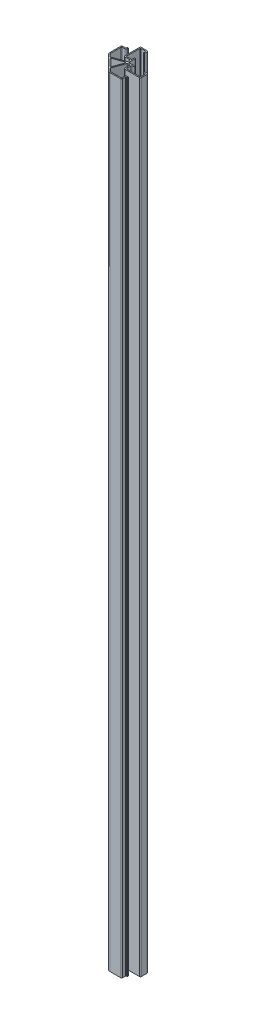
from build123d import *

# Parameters (mm, degrees)
BOSS_EXTRU_1_DEPTH = 620
CONG_1_R           = 0.5


with BuildPart() as part:
    # Esquisse1 → Boss.-Extru.1 (new body)
    with BuildSketch(Plane(origin=(0, 0, 0), x_dir=(1, 0, 0), z_dir=(0, 1, 0))):
        with BuildLine():
            Line((0, 0), (5.25, 0))
            ThreePointArc((5.25, 0), (5.462132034, -0.087867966), (5.55, -0.3))
            Line((5.55, -0.3), (5.55, -0.55))
            ThreePointArc((5.55, -0.55), (5.462132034, -0.762132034), (5.25, -0.85))
            Line((5.25, -0.85), (3.75, -0.85))
            ThreePointArc((3.75, -0.85), (3.396446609, -0.996446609), (3.25, -1.35))
            Line((3.25, -1.35), (3.25, -4.75))
            ThreePointArc((3.25, -4.75), (3.396446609, -5.103553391), (3.75, -5.25))
            Line((3.75, -5.25), (14.15, -5.25))
            ThreePointArc((14.15, -5.25), (14.503553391, -5.103553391), (14.65, -4.75))
            Line((14.65, -4.75), (14.65, -1.35))
            ThreePointArc((14.65, -1.35), (14.503553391, -0.996446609), (14.15, -0.85))
            Line((14.15, -0.85), (12.65, -0.85))
            ThreePointArc((12.65, -0.85), (12.437867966, -0.762132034), (12.35, -0.55))
            Line((12.35, -0.55), (12.35, -0.3))
            ThreePointArc((12.35, -0.3), (12.437867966, -0.087867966), (12.65, 0))
            Line((12.65, 0), (14.7, 0))
            ThreePointArc((14.7, 0), (15.265685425, -0.234314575), (15.5, -0.8))
            Line((15.5, -0.8), (15.5, -5.3))
            ThreePointArc((15.5, -5.3), (15.265685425, -5.865685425), (14.7, -6.1))
            Line((14.7, -6.1), (3.197, -6.1))
            ThreePointArc((3.197, -6.1), (2.631314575, -5.865685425), (2.397, -5.3))
            Line((2.397, -5.3), (2.397, -1.35))
            ThreePointArc((2.397, -1.35), (2.250553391, -0.996446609), (1.897, -0.85))
            Line((1.897, -0.85), (0.534636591, -0.85))
            ThreePointArc((0.534636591, -0.85), (0.247848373, -0.940423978), (0.064790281, -1.178989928))
            Line((0.064790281, -1.178989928), (-3.491054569, -10.94859336))
            ThreePointArc((-3.491054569, -10.94859336), (-3.509356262, -11.227823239), (-3.374761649, -11.473156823))
            Line((-3.374761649, -11.473156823), (-1.444365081, -13.403553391))
            ThreePointArc((-1.444365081, -13.403553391), (-1.282153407, -13.511939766), (-1.090811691, -13.55))
            Line((-1.090811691, -13.55), (7.5, -13.55))
            ThreePointArc((7.5, -13.55), (7.853553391, -13.403553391), (8, -13.05))
            Line((8, -13.05), (8, -10.9))
            ThreePointArc((8, -10.9), (8.234314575, -10.334314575), (8.8, -10.1))
            Line((8.8, -10.1), (9.7, -10.1))
            ThreePointArc((9.7, -10.1), (9.912132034, -10.187867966), (10, -10.4))
            Line((10, -10.4), (10, -10.65))
            ThreePointArc((10, -10.65), (9.912132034, -10.862132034), (9.7, -10.95))
            Line((9.7, -10.95), (9.35, -10.95))
            ThreePointArc((9.35, -10.95), (8.996446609, -11.096446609), (8.85, -11.45))
            Line((8.85, -11.45), (8.85, -13.6))
            ThreePointArc((8.85, -13.6), (8.615685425, -14.165685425), (8.05, -14.4))
            Line((8.05, -14.4), (-0.407359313, -14.4))
            ThreePointArc((-0.407359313, -14.4), (-1.55540961, -14.171638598), (-2.528679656, -13.521320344))
            Line((-2.528679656, -13.521320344), (-8.025, -8.025))
            Line((-8.025, -8.025), (-13.521320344, -2.528679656))
            ThreePointArc((-13.521320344, -2.528679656), (-14.171638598, -1.55540961), (-14.4, -0.407359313))
            Line((-14.4, -0.407359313), (-14.4, 8.05))
            ThreePointArc((-14.4, 8.05), (-14.165685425, 8.615685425), (-13.6, 8.85))
            Line((-13.6, 8.85), (-11.45, 8.85))
            ThreePointArc((-11.45, 8.85), (-11.096446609, 8.996446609), (-10.95, 9.35))
            Line((-10.95, 9.35), (-10.95, 9.7))
            ThreePointArc((-10.95, 9.7), (-10.862132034, 9.912132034), (-10.65, 10))
            Line((-10.65, 10), (-10.4, 10))
            ThreePointArc((-10.4, 10), (-10.187867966, 9.912132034), (-10.1, 9.7))
            Line((-10.1, 9.7), (-10.1, 8.8))
            ThreePointArc((-10.1, 8.8), (-10.334314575, 8.234314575), (-10.9, 8))
            Line((-10.9, 8), (-13.05, 8))
            ThreePointArc((-13.05, 8), (-13.403553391, 7.853553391), (-13.55, 7.5))
            Line((-13.55, 7.5), (-13.55, -1.090811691))
            ThreePointArc((-13.55, -1.090811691), (-13.511939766, -1.282153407), (-13.403553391, -1.444365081))
            Line((-13.403553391, -1.444365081), (-11.473156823, -3.374761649))
            ThreePointArc((-11.473156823, -3.374761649), (-11.227823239, -3.509356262), (-10.94859336, -3.491054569))
            Line((-10.94859336, -3.491054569), (-1.178989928, 0.064790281))
            ThreePointArc((-1.178989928, 0.064790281), (-0.940423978, 0.247848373), (-0.85, 0.534636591))
            Line((-0.85, 0.534636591), (-0.85, 1.897))
            ThreePointArc((-0.85, 1.897), (-0.996446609, 2.250553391), (-1.35, 2.397))
            Line((-1.35, 2.397), (-5.3, 2.397))
            ThreePointArc((-5.3, 2.397), (-5.865685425, 2.631314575), (-6.1, 3.197))
            Line((-6.1, 3.197), (-6.1, 14.7))
            ThreePointArc((-6.1, 14.7), (-5.865685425, 15.265685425), (-5.3, 15.5))
            Line((-5.3, 15.5), (-0.8, 15.5))
            ThreePointArc((-0.8, 15.5), (-0.234314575, 15.265685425), (0, 14.7))
            Line((0, 14.7), (0, 12.65))
            ThreePointArc((0, 12.65), (-0.087867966, 12.437867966), (-0.3, 12.35))
            Line((-0.3, 12.35), (-0.55, 12.35))
            ThreePointArc((-0.55, 12.35), (-0.762132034, 12.437867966), (-0.85, 12.65))
            Line((-0.85, 12.65), (-0.85, 14.15))
            ThreePointArc((-0.85, 14.15), (-0.996446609, 14.503553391), (-1.35, 14.65))
            Line((-1.35, 14.65), (-4.75, 14.65))
            ThreePointArc((-4.75, 14.65), (-5.103553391, 14.503553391), (-5.25, 14.15))
            Line((-5.25, 14.15), (-5.25, 3.75))
            ThreePointArc((-5.25, 3.75), (-5.103553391, 3.396446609), (-4.75, 3.25))
            Line((-4.75, 3.25), (-1.35, 3.25))
            ThreePointArc((-1.35, 3.25), (-0.996446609, 3.396446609), (-0.85, 3.75))
            Line((-0.85, 3.75), (-0.85, 5.25))
            ThreePointArc((-0.85, 5.25), (-0.762132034, 5.462132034), (-0.55, 5.55))
            Line((-0.55, 5.55), (-0.3, 5.55))
            ThreePointArc((-0.3, 5.55), (-0.087867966, 5.462132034), (0, 5.25))
            Line((0, 5.25), (0, 0))
        make_face()
        with BuildLine():
            Line((-9.847232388, -3.994743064), (-0.645635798, -0.645635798))
            Line((-0.645635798, -0.645635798), (-3.994743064, -9.847232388))
            ThreePointArc((-3.994743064, -9.847232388), (-4.356369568, -10.16437032), (-4.818142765, -10.029775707))
            Line((-4.818142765, -10.029775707), (-7.423959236, -7.423959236))
            Line((-7.423959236, -7.423959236), (-10.029775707, -4.818142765))
            ThreePointArc((-10.029775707, -4.818142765), (-10.16437032, -4.356369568), (-9.847232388, -3.994743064))
        make_face(mode=Mode.SUBTRACT)
    extrude(amount=BOSS_EXTRU_1_DEPTH)

    # Cong_1
    cong_1_edges = [part.edges().sort_by_distance(p)[0] for p in [
        (-0.645635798, 310, 0.645635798),
    ]]
    fillet(cong_1_edges, radius=CONG_1_R)


solid = part.part
